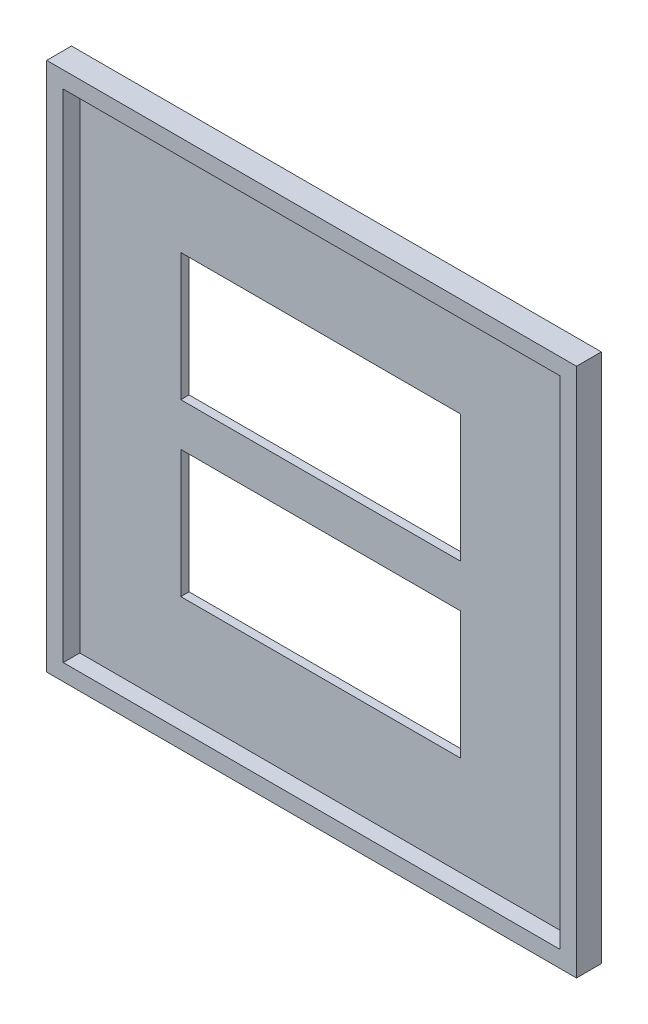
from build123d import *

# Parameters (mm, degrees)
SKETCH1_W           = 81.28
SKETCH1_H           = 81.28
BOSS_EXTRUDE1_DEPTH = 3.81
SKETCH2_W           = 76.2
SKETCH2_H           = 76.2
CUT_EXTRUDE1_DEPTH  = 2.54
SKETCH3_W           = 42.926
SKETCH3_H           = 19.558
CUT_EXTRUDE2_DEPTH  = 58.59978559


with BuildPart() as part:
    # Sketch1 → Boss-Extrude1 (new body)
    with BuildSketch(Plane.XY):
        Rectangle(SKETCH1_W, SKETCH1_H)
    extrude(amount=BOSS_EXTRUDE1_DEPTH)

    # Sketch2 → Cut-Extrude1 (cut)
    with BuildSketch(Plane.XY.offset(3.81)):
        Rectangle(SKETCH2_W, SKETCH2_H)
    extrude(amount=-CUT_EXTRUDE1_DEPTH, mode=Mode.SUBTRACT)

    # Sketch3 → Cut-Extrude2 (cut, through all)
    with BuildSketch(Plane(origin=(0, 0, 0), x_dir=(-1, 0, 0), z_dir=(0, 0, -1))):
        with Locations((1.143, 13.081)):
            Rectangle(SKETCH3_W, SKETCH3_H)
        with Locations((1.143, -13.081)):
            Rectangle(SKETCH3_W, SKETCH3_H)
    extrude(amount=-CUT_EXTRUDE2_DEPTH, mode=Mode.SUBTRACT)


solid = part.part
